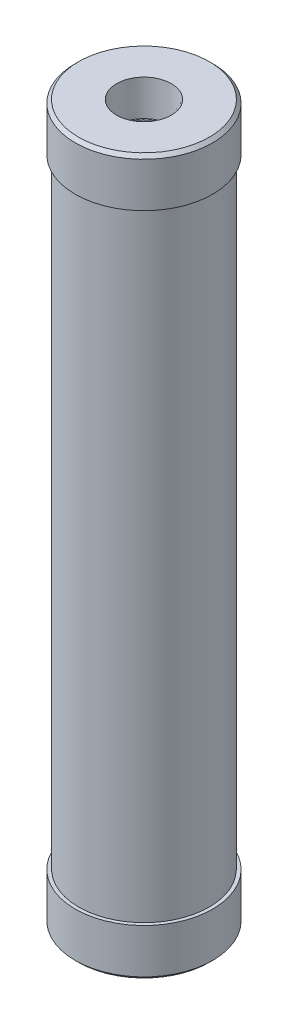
from build123d import *

# Parameters (mm, degrees)
SKETCH1_R           = 30.1625
SKETCH1_R_2         = 25.9969
BOSS_EXTRUDE1_DEPTH = 330.2
SKETCH2_R           = 31.75
BOSS_EXTRUDE2_DEPTH = 22.098
BOSS_EXTRUDE3_START = 22.098
SKETCH5_R           = 31.75
BOSS_EXTRUDE3_DEPTH = 22.098
CHAMFER1_SIZE       = 1.524


with BuildPart() as part:
    # Sketch1 → Boss-Extrude1 (new body)
    with BuildSketch(Plane(origin=(0, 0, 0), x_dir=(1, 0, 0), z_dir=(0, 1, 0))):
        with Locations(Location((0, 0, 0), (0, 0, 270))):
            Circle(SKETCH1_R)
        with Locations(Location((0, 0, 0), (0, 0, 270))):
            Circle(SKETCH1_R_2, mode=Mode.SUBTRACT)
    extrude(amount=BOSS_EXTRUDE1_DEPTH)

    # Sketch2 → Boss-Extrude2 (add)
    with BuildSketch(Plane(origin=(0, 330.2, 0), x_dir=(1, 0, 0), z_dir=(0, 1, 0))):
        with Locations(Location((0, 0, 0), (0, 0, 270))):
            Circle(SKETCH2_R)
    extrude(amount=-BOSS_EXTRUDE2_DEPTH)

    # Sketch3 → 3_4 Rc Tapped Hole1 (revolve, cut)
    with BuildSketch(Plane(origin=(0, 330.2, 0), x_dir=(0, 0, 1), z_dir=(1, 0, 0))):
        Polygon((0, 0), (0, 32.309897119), (11.5, 25.4), (11.5, 16.256), (12.130669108, 16.256), (12.6381265, 0), align=None)
    revolve(axis=Axis((0, 336.55, 0), (0, -1, 0)), mode=Mode.SUBTRACT)

    # Sketch5 → Boss-Extrude3 (add)
    with BuildSketch(Plane(origin=(0, 0, 0), x_dir=(1, 0, 0), z_dir=(0, 1, 0)).offset(BOSS_EXTRUDE3_START)):
        with Locations(Location((0, 0, 0), (0, 0, 270))):
            Circle(SKETCH5_R)
    extrude(amount=-BOSS_EXTRUDE3_DEPTH)

    # Sketch6 → 3_4 Rc Tapped Hole2 (revolve, cut)
    with BuildSketch(Plane(origin=(0, 0, 0), x_dir=(0, 0, -1), z_dir=(1, 0, 0))):
        Polygon((0, 0), (0, 32.309897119), (11.5, 25.4), (11.5, 16.256), (12.130669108, 16.256), (12.6381265, 0), align=None)
    revolve(axis=Axis((0, -6.35, 0), (0, 1, 0)), mode=Mode.SUBTRACT)

    # Chamfer1
    chamfer1_edges = [part.edges().sort_by_distance(p)[0] for p in [
        (0, 330.2, -31.75),
        (0, 0, -31.75),
    ]]
    chamfer(chamfer1_edges, length=CHAMFER1_SIZE)


solid = part.part
